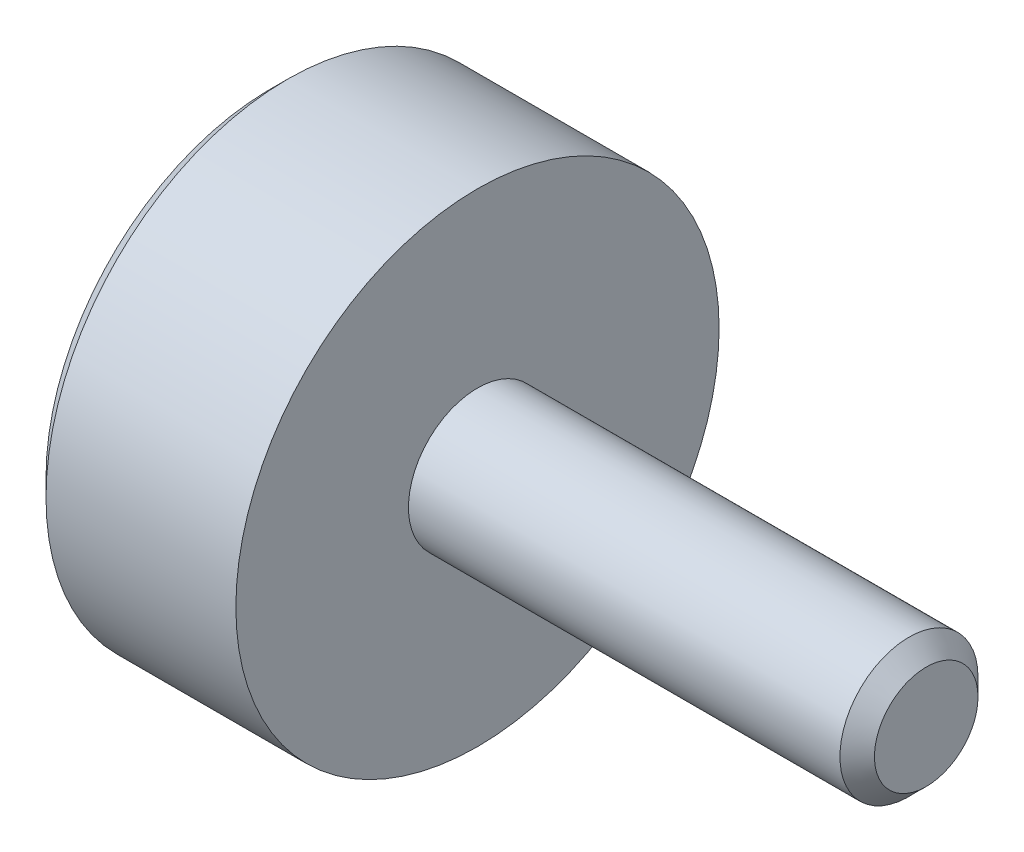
from build123d import *

# Parameters (mm, degrees)
CHAMFER1_SIZE      = 1.5875
CUT_EXTRUDE1_DEPTH = 12.7


with BuildPart() as part:
    # Sketch1 → Revolve1 (revolve)
    with BuildSketch(Plane.XY, mode=Mode.PRIVATE) as revolve1_sk:
        Polygon((22.225, 6.35), (-19.05, 6.35), (-19.05, 22.225), (-38.1, 22.225), (-38.1, 0), (22.225, 0), align=None)
    revolve(revolve1_sk.sketch.rotate(Axis((0, 0, 0), (-1, 0, 0)), 90), axis=Axis((0, 0, 0), (-1, 0, 0)))

    # Chamfer1
    chamfer1_edges = [part.edges().sort_by_distance(p)[0] for p in [
        (22.225, 0, 6.35),
        (-38.1, 0, 22.225),
    ]]
    chamfer(chamfer1_edges, length=CHAMFER1_SIZE)

    # Sketch2 → Cut-Extrude1 (cut)
    with BuildSketch(Plane.ZY.offset(38.1)):
        Polygon((14.664696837, 0), (7.332348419, 12.7), (-7.332348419, 12.7), (-14.664696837, 0), (-7.332348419, -12.7), (7.332348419, -12.7), align=None)
    extrude(amount=-CUT_EXTRUDE1_DEPTH, mode=Mode.SUBTRACT)


solid = part.part
